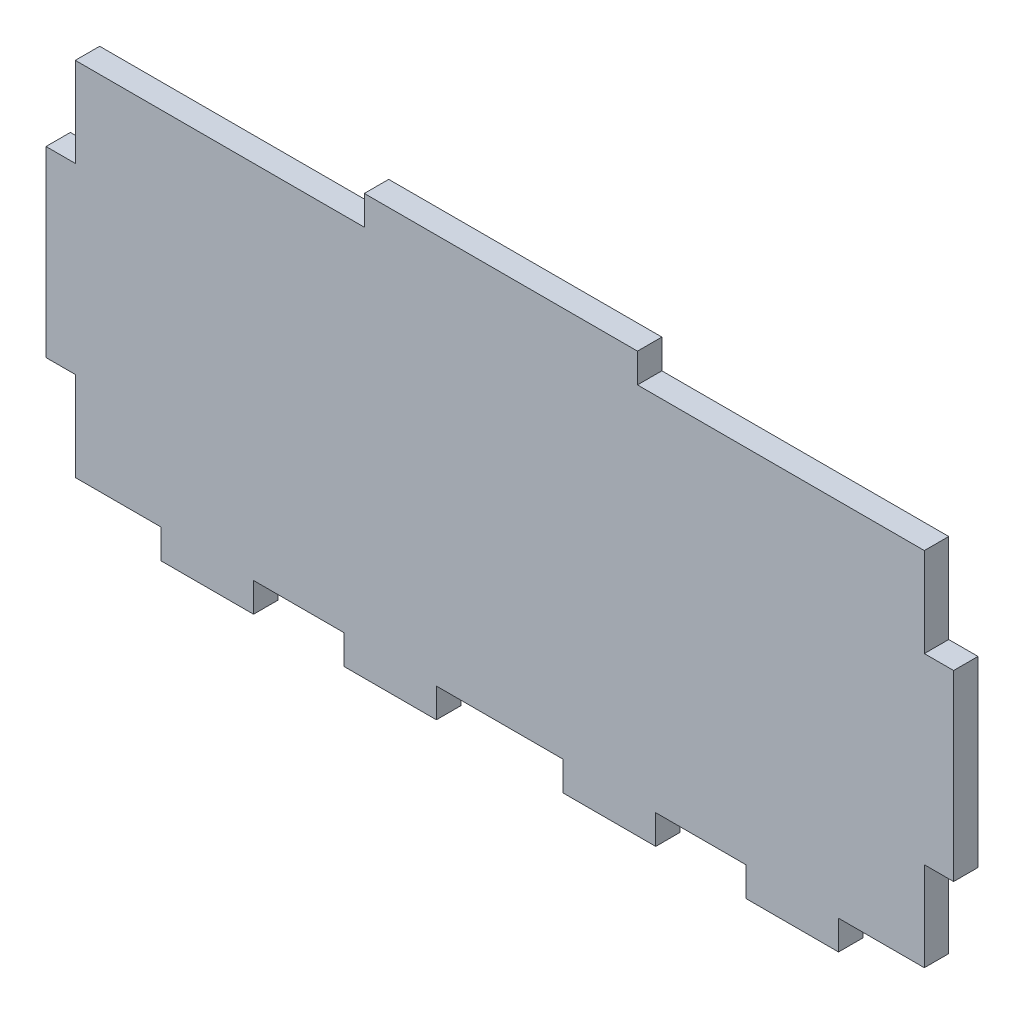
ISO-10303-21;
HEADER;
FILE_DESCRIPTION(('STEP AP214'),'2;1');
FILE_NAME('part.step','',(''),(''),'','','');
FILE_SCHEMA(('AUTOMOTIVE_DESIGN { 1 0 10303 214 1 1 1 1 }'));
ENDSEC;
DATA;
#1=APPLICATION_CONTEXT('core data for automotive mechanical design processes');
#2=APPLICATION_PROTOCOL_DEFINITION('international standard','automotive_design',2000,#1);
#3=PRODUCT_CONTEXT('',#1,'mechanical');
#4=PRODUCT('Part','Part','',(#3));
#5=PRODUCT_RELATED_PRODUCT_CATEGORY('part','',(#4));
#6=PRODUCT_DEFINITION_FORMATION('','',#4);
#7=PRODUCT_DEFINITION_CONTEXT('part definition',#1,'design');
#8=PRODUCT_DEFINITION('design','',#6,#7);
#9=PRODUCT_DEFINITION_SHAPE('','',#8);
#10=(LENGTH_UNIT() NAMED_UNIT(*) SI_UNIT(.MILLI.,.METRE.));
#11=(NAMED_UNIT(*) PLANE_ANGLE_UNIT() SI_UNIT($,.RADIAN.));
#12=(NAMED_UNIT(*) SI_UNIT($,.STERADIAN.) SOLID_ANGLE_UNIT());
#13=UNCERTAINTY_MEASURE_WITH_UNIT(LENGTH_MEASURE(1.E-05),#10,'distance_accuracy_value','');
#14=(GEOMETRIC_REPRESENTATION_CONTEXT(3) GLOBAL_UNCERTAINTY_ASSIGNED_CONTEXT((#13)) GLOBAL_UNIT_ASSIGNED_CONTEXT((#10,
#11,#12)) REPRESENTATION_CONTEXT('',''));
#15=CARTESIAN_POINT('',(0.,0.,0.));
#16=DIRECTION('',(0.,0.,1.));
#17=DIRECTION('',(1.,0.,0.));
#18=AXIS2_PLACEMENT_3D('',#15,#16,#17);
#19=CARTESIAN_POINT('',(-15.,20.,2.7));
#20=DIRECTION('',(0.,-1.,0.));
#21=DIRECTION('',(1.,0.,0.));
#22=AXIS2_PLACEMENT_3D('',#19,#20,#21);
#23=PLANE('',#22);
#24=DIRECTION('',(-1.,0.,0.));
#25=VECTOR('',#24,1.);
#26=CARTESIAN_POINT('',(-15.,20.,0.));
#27=LINE('',#26,#25);
#28=CARTESIAN_POINT('',(-15.,20.,0.));
#29=VERTEX_POINT('',#28);
#30=CARTESIAN_POINT('',(-47.,20.,0.));
#31=VERTEX_POINT('',#30);
#32=EDGE_CURVE('E281',#29,#31,#27,.T.);
#33=ORIENTED_EDGE('',*,*,#32,.T.);
#34=DIRECTION('',(0.,0.,-1.));
#35=VECTOR('',#34,1.);
#36=CARTESIAN_POINT('',(-47.,20.,2.7));
#37=LINE('',#36,#35);
#38=CARTESIAN_POINT('',(-47.,20.,2.7));
#39=VERTEX_POINT('',#38);
#40=EDGE_CURVE('E11',#39,#31,#37,.T.);
#41=ORIENTED_EDGE('',*,*,#40,.F.);
#42=DIRECTION('',(-1.,0.,0.));
#43=VECTOR('',#42,1.);
#44=CARTESIAN_POINT('',(-15.,20.,2.7));
#45=LINE('',#44,#43);
#46=CARTESIAN_POINT('',(-15.,20.,2.7));
#47=VERTEX_POINT('',#46);
#48=EDGE_CURVE('E343',#47,#39,#45,.T.);
#49=ORIENTED_EDGE('',*,*,#48,.F.);
#50=DIRECTION('',(0.,0.,-1.));
#51=VECTOR('',#50,1.);
#52=CARTESIAN_POINT('',(-15.,20.,2.7));
#53=LINE('',#52,#51);
#54=EDGE_CURVE('E277',#47,#29,#53,.T.);
#55=ORIENTED_EDGE('',*,*,#54,.T.);
#56=EDGE_LOOP('',(#33,#41,#49,#55));
#57=FACE_BOUND('',#56,.T.);
#58=ADVANCED_FACE('F41',(#57),#23,.F.);
#59=CARTESIAN_POINT('',(-47.,10.12,2.7));
#60=DIRECTION('',(1.,0.,0.));
#61=DIRECTION('',(0.,0.,-1.));
#62=AXIS2_PLACEMENT_3D('',#59,#60,#61);
#63=PLANE('',#62);
#64=DIRECTION('',(0.,-1.,0.));
#65=VECTOR('',#64,1.);
#66=CARTESIAN_POINT('',(-47.,10.12,0.));
#67=LINE('',#66,#65);
#68=CARTESIAN_POINT('',(-47.,10.12,0.));
#69=VERTEX_POINT('',#68);
#70=EDGE_CURVE('E284',#31,#69,#67,.T.);
#71=ORIENTED_EDGE('',*,*,#70,.T.);
#72=DIRECTION('',(0.,0.,-1.));
#73=VECTOR('',#72,1.);
#74=CARTESIAN_POINT('',(-47.,10.12,2.7));
#75=LINE('',#74,#73);
#76=CARTESIAN_POINT('',(-47.,10.12,2.7));
#77=VERTEX_POINT('',#76);
#78=EDGE_CURVE('E49',#77,#69,#75,.T.);
#79=ORIENTED_EDGE('',*,*,#78,.F.);
#80=DIRECTION('',(0.,-1.,0.));
#81=VECTOR('',#80,1.);
#82=CARTESIAN_POINT('',(-47.,10.12,2.7));
#83=LINE('',#82,#81);
#84=EDGE_CURVE('E172',#39,#77,#83,.T.);
#85=ORIENTED_EDGE('',*,*,#84,.F.);
#86=ORIENTED_EDGE('',*,*,#40,.T.);
#87=EDGE_LOOP('',(#71,#79,#85,#86));
#88=FACE_BOUND('',#87,.T.);
#89=ADVANCED_FACE('F521',(#88),#63,.F.);
#90=CARTESIAN_POINT('',(-47.,10.12,2.7));
#91=DIRECTION('',(0.,-1.,0.));
#92=DIRECTION('',(0.,0.,-1.));
#93=AXIS2_PLACEMENT_3D('',#90,#91,#92);
#94=PLANE('',#93);
#95=DIRECTION('',(-1.,0.,0.));
#96=VECTOR('',#95,1.);
#97=CARTESIAN_POINT('',(-47.,10.12,0.));
#98=LINE('',#97,#96);
#99=CARTESIAN_POINT('',(-50.24,10.12,0.));
#100=VERTEX_POINT('',#99);
#101=EDGE_CURVE('E286',#69,#100,#98,.T.);
#102=ORIENTED_EDGE('',*,*,#101,.T.);
#103=DIRECTION('',(0.,0.,-1.));
#104=VECTOR('',#103,1.);
#105=CARTESIAN_POINT('',(-50.24,10.12,2.7));
#106=LINE('',#105,#104);
#107=CARTESIAN_POINT('',(-50.24,10.12,2.7));
#108=VERTEX_POINT('',#107);
#109=EDGE_CURVE('E422',#108,#100,#106,.T.);
#110=ORIENTED_EDGE('',*,*,#109,.F.);
#111=DIRECTION('',(-1.,0.,0.));
#112=VECTOR('',#111,1.);
#113=CARTESIAN_POINT('',(-47.,10.12,2.7));
#114=LINE('',#113,#112);
#115=EDGE_CURVE('E430',#77,#108,#114,.T.);
#116=ORIENTED_EDGE('',*,*,#115,.F.);
#117=ORIENTED_EDGE('',*,*,#78,.T.);
#118=EDGE_LOOP('',(#102,#110,#116,#117));
#119=FACE_BOUND('',#118,.T.);
#120=ADVANCED_FACE('F428',(#119),#94,.F.);
#121=CARTESIAN_POINT('',(-50.24,10.12,2.7));
#122=DIRECTION('',(1.,0.,0.));
#123=DIRECTION('',(0.,0.,-1.));
#124=AXIS2_PLACEMENT_3D('',#121,#122,#123);
#125=PLANE('',#124);
#126=DIRECTION('',(0.,-1.,0.));
#127=VECTOR('',#126,1.);
#128=CARTESIAN_POINT('',(-50.24,10.12,0.));
#129=LINE('',#128,#127);
#130=CARTESIAN_POINT('',(-50.24,-10.12,0.));
#131=VERTEX_POINT('',#130);
#132=EDGE_CURVE('E288',#100,#131,#129,.T.);
#133=ORIENTED_EDGE('',*,*,#132,.T.);
#134=DIRECTION('',(0.,0.,-1.));
#135=VECTOR('',#134,1.);
#136=CARTESIAN_POINT('',(-50.24,-10.12,2.7));
#137=LINE('',#136,#135);
#138=CARTESIAN_POINT('',(-50.24,-10.12,2.7));
#139=VERTEX_POINT('',#138);
#140=EDGE_CURVE('E419',#139,#131,#137,.T.);
#141=ORIENTED_EDGE('',*,*,#140,.F.);
#142=DIRECTION('',(0.,-1.,0.));
#143=VECTOR('',#142,1.);
#144=CARTESIAN_POINT('',(-50.24,10.12,2.7));
#145=LINE('',#144,#143);
#146=EDGE_CURVE('E448',#108,#139,#145,.T.);
#147=ORIENTED_EDGE('',*,*,#146,.F.);
#148=ORIENTED_EDGE('',*,*,#109,.T.);
#149=EDGE_LOOP('',(#133,#141,#147,#148));
#150=FACE_BOUND('',#149,.T.);
#151=ADVANCED_FACE('F439',(#150),#125,.F.);
#152=CARTESIAN_POINT('',(-47.,-10.12,2.7));
#153=DIRECTION('',(0.,1.,0.));
#154=DIRECTION('',(0.,0.,1.));
#155=AXIS2_PLACEMENT_3D('',#152,#153,#154);
#156=PLANE('',#155);
#157=DIRECTION('',(1.,0.,0.));
#158=VECTOR('',#157,1.);
#159=CARTESIAN_POINT('',(-47.,-10.12,0.));
#160=LINE('',#159,#158);
#161=CARTESIAN_POINT('',(-47.,-10.12,0.));
#162=VERTEX_POINT('',#161);
#163=EDGE_CURVE('E290',#131,#162,#160,.T.);
#164=ORIENTED_EDGE('',*,*,#163,.T.);
#165=DIRECTION('',(0.,0.,-1.));
#166=VECTOR('',#165,1.);
#167=CARTESIAN_POINT('',(-47.,-10.12,2.7));
#168=LINE('',#167,#166);
#169=CARTESIAN_POINT('',(-47.,-10.12,2.7));
#170=VERTEX_POINT('',#169);
#171=EDGE_CURVE('E416',#170,#162,#168,.T.);
#172=ORIENTED_EDGE('',*,*,#171,.F.);
#173=DIRECTION('',(1.,0.,0.));
#174=VECTOR('',#173,1.);
#175=CARTESIAN_POINT('',(-47.,-10.12,2.7));
#176=LINE('',#175,#174);
#177=EDGE_CURVE('E445',#139,#170,#176,.T.);
#178=ORIENTED_EDGE('',*,*,#177,.F.);
#179=ORIENTED_EDGE('',*,*,#140,.T.);
#180=EDGE_LOOP('',(#164,#172,#178,#179));
#181=FACE_BOUND('',#180,.T.);
#182=ADVANCED_FACE('F443',(#181),#156,.F.);
#183=CARTESIAN_POINT('',(-47.,-20.,2.7));
#184=DIRECTION('',(1.,0.,0.));
#185=DIRECTION('',(0.,0.,-1.));
#186=AXIS2_PLACEMENT_3D('',#183,#184,#185);
#187=PLANE('',#186);
#188=DIRECTION('',(0.,-1.,0.));
#189=VECTOR('',#188,1.);
#190=CARTESIAN_POINT('',(-47.,-20.,0.));
#191=LINE('',#190,#189);
#192=CARTESIAN_POINT('',(-47.,-20.,0.));
#193=VERTEX_POINT('',#192);
#194=EDGE_CURVE('E292',#162,#193,#191,.T.);
#195=ORIENTED_EDGE('',*,*,#194,.T.);
#196=DIRECTION('',(0.,0.,-1.));
#197=VECTOR('',#196,1.);
#198=CARTESIAN_POINT('',(-47.,-20.,2.7));
#199=LINE('',#198,#197);
#200=CARTESIAN_POINT('',(-47.,-20.,2.7));
#201=VERTEX_POINT('',#200);
#202=EDGE_CURVE('E413',#201,#193,#199,.T.);
#203=ORIENTED_EDGE('',*,*,#202,.F.);
#204=DIRECTION('',(0.,-1.,0.));
#205=VECTOR('',#204,1.);
#206=CARTESIAN_POINT('',(-47.,-20.,2.7));
#207=LINE('',#206,#205);
#208=EDGE_CURVE('E447',#170,#201,#207,.T.);
#209=ORIENTED_EDGE('',*,*,#208,.F.);
#210=ORIENTED_EDGE('',*,*,#171,.T.);
#211=EDGE_LOOP('',(#195,#203,#209,#210));
#212=FACE_BOUND('',#211,.T.);
#213=ADVANCED_FACE('F534',(#212),#187,.F.);
#214=CARTESIAN_POINT('',(-37.5,-20.,2.7));
#215=DIRECTION('',(0.,1.,0.));
#216=DIRECTION('',(-1.,0.,0.));
#217=AXIS2_PLACEMENT_3D('',#214,#215,#216);
#218=PLANE('',#217);
#219=DIRECTION('',(1.,0.,0.));
#220=VECTOR('',#219,1.);
#221=CARTESIAN_POINT('',(-37.5,-20.,0.));
#222=LINE('',#221,#220);
#223=CARTESIAN_POINT('',(-37.5,-20.,0.));
#224=VERTEX_POINT('',#223);
#225=EDGE_CURVE('E294',#193,#224,#222,.T.);
#226=ORIENTED_EDGE('',*,*,#225,.T.);
#227=DIRECTION('',(0.,0.,-1.));
#228=VECTOR('',#227,1.);
#229=CARTESIAN_POINT('',(-37.5,-20.,2.7));
#230=LINE('',#229,#228);
#231=CARTESIAN_POINT('',(-37.5,-20.,2.7));
#232=VERTEX_POINT('',#231);
#233=EDGE_CURVE('E410',#232,#224,#230,.T.);
#234=ORIENTED_EDGE('',*,*,#233,.F.);
#235=DIRECTION('',(1.,0.,0.));
#236=VECTOR('',#235,1.);
#237=CARTESIAN_POINT('',(-37.5,-20.,2.7));
#238=LINE('',#237,#236);
#239=EDGE_CURVE('E450',#201,#232,#238,.T.);
#240=ORIENTED_EDGE('',*,*,#239,.F.);
#241=ORIENTED_EDGE('',*,*,#202,.T.);
#242=EDGE_LOOP('',(#226,#234,#240,#241));
#243=FACE_BOUND('',#242,.T.);
#244=ADVANCED_FACE('F537',(#243),#218,.F.);
#245=CARTESIAN_POINT('',(-37.5,-20.,2.7));
#246=DIRECTION('',(1.,0.,0.));
#247=DIRECTION('',(0.,0.,-1.));
#248=AXIS2_PLACEMENT_3D('',#245,#246,#247);
#249=PLANE('',#248);
#250=DIRECTION('',(0.,-1.,0.));
#251=VECTOR('',#250,1.);
#252=CARTESIAN_POINT('',(-37.5,-20.,0.));
#253=LINE('',#252,#251);
#254=CARTESIAN_POINT('',(-37.5,-23.24,0.));
#255=VERTEX_POINT('',#254);
#256=EDGE_CURVE('E296',#224,#255,#253,.T.);
#257=ORIENTED_EDGE('',*,*,#256,.T.);
#258=DIRECTION('',(0.,0.,-1.));
#259=VECTOR('',#258,1.);
#260=CARTESIAN_POINT('',(-37.5,-23.24,2.7));
#261=LINE('',#260,#259);
#262=CARTESIAN_POINT('',(-37.5,-23.24,2.7));
#263=VERTEX_POINT('',#262);
#264=EDGE_CURVE('E407',#263,#255,#261,.T.);
#265=ORIENTED_EDGE('',*,*,#264,.F.);
#266=DIRECTION('',(0.,-1.,0.));
#267=VECTOR('',#266,1.);
#268=CARTESIAN_POINT('',(-37.5,-20.,2.7));
#269=LINE('',#268,#267);
#270=EDGE_CURVE('E456',#232,#263,#269,.T.);
#271=ORIENTED_EDGE('',*,*,#270,.F.);
#272=ORIENTED_EDGE('',*,*,#233,.T.);
#273=EDGE_LOOP('',(#257,#265,#271,#272));
#274=FACE_BOUND('',#273,.T.);
#275=ADVANCED_FACE('F541',(#274),#249,.F.);
#276=CARTESIAN_POINT('',(-37.5,-23.24,2.7));
#277=DIRECTION('',(0.,1.,0.));
#278=DIRECTION('',(0.,0.,1.));
#279=AXIS2_PLACEMENT_3D('',#276,#277,#278);
#280=PLANE('',#279);
#281=DIRECTION('',(1.,0.,0.));
#282=VECTOR('',#281,1.);
#283=CARTESIAN_POINT('',(-37.5,-23.24,0.));
#284=LINE('',#283,#282);
#285=CARTESIAN_POINT('',(-27.26,-23.24,0.));
#286=VERTEX_POINT('',#285);
#287=EDGE_CURVE('E298',#255,#286,#284,.T.);
#288=ORIENTED_EDGE('',*,*,#287,.T.);
#289=DIRECTION('',(0.,0.,-1.));
#290=VECTOR('',#289,1.);
#291=CARTESIAN_POINT('',(-27.26,-23.24,2.7));
#292=LINE('',#291,#290);
#293=CARTESIAN_POINT('',(-27.26,-23.24,2.7));
#294=VERTEX_POINT('',#293);
#295=EDGE_CURVE('E404',#294,#286,#292,.T.);
#296=ORIENTED_EDGE('',*,*,#295,.F.);
#297=DIRECTION('',(1.,0.,0.));
#298=VECTOR('',#297,1.);
#299=CARTESIAN_POINT('',(-37.5,-23.24,2.7));
#300=LINE('',#299,#298);
#301=EDGE_CURVE('E458',#263,#294,#300,.T.);
#302=ORIENTED_EDGE('',*,*,#301,.F.);
#303=ORIENTED_EDGE('',*,*,#264,.T.);
#304=EDGE_LOOP('',(#288,#296,#302,#303));
#305=FACE_BOUND('',#304,.T.);
#306=ADVANCED_FACE('F545',(#305),#280,.F.);
#307=CARTESIAN_POINT('',(-27.26,-20.,2.7));
#308=DIRECTION('',(-1.,0.,0.));
#309=DIRECTION('',(0.,0.,1.));
#310=AXIS2_PLACEMENT_3D('',#307,#308,#309);
#311=PLANE('',#310);
#312=DIRECTION('',(0.,1.,0.));
#313=VECTOR('',#312,1.);
#314=CARTESIAN_POINT('',(-27.26,-20.,0.));
#315=LINE('',#314,#313);
#316=CARTESIAN_POINT('',(-27.26,-20.,0.));
#317=VERTEX_POINT('',#316);
#318=EDGE_CURVE('E300',#286,#317,#315,.T.);
#319=ORIENTED_EDGE('',*,*,#318,.T.);
#320=DIRECTION('',(0.,0.,-1.));
#321=VECTOR('',#320,1.);
#322=CARTESIAN_POINT('',(-27.26,-20.,2.7));
#323=LINE('',#322,#321);
#324=CARTESIAN_POINT('',(-27.26,-20.,2.7));
#325=VERTEX_POINT('',#324);
#326=EDGE_CURVE('E401',#325,#317,#323,.T.);
#327=ORIENTED_EDGE('',*,*,#326,.F.);
#328=DIRECTION('',(0.,1.,0.));
#329=VECTOR('',#328,1.);
#330=CARTESIAN_POINT('',(-27.26,-20.,2.7));
#331=LINE('',#330,#329);
#332=EDGE_CURVE('E460',#294,#325,#331,.T.);
#333=ORIENTED_EDGE('',*,*,#332,.F.);
#334=ORIENTED_EDGE('',*,*,#295,.T.);
#335=EDGE_LOOP('',(#319,#327,#333,#334));
#336=FACE_BOUND('',#335,.T.);
#337=ADVANCED_FACE('F549',(#336),#311,.F.);
#338=CARTESIAN_POINT('',(-17.26,-20.,2.7));
#339=DIRECTION('',(0.,1.,0.));
#340=DIRECTION('',(0.,0.,1.));
#341=AXIS2_PLACEMENT_3D('',#338,#339,#340);
#342=PLANE('',#341);
#343=DIRECTION('',(1.,0.,0.));
#344=VECTOR('',#343,1.);
#345=CARTESIAN_POINT('',(-17.26,-20.,0.));
#346=LINE('',#345,#344);
#347=CARTESIAN_POINT('',(-17.26,-20.,0.));
#348=VERTEX_POINT('',#347);
#349=EDGE_CURVE('E302',#317,#348,#346,.T.);
#350=ORIENTED_EDGE('',*,*,#349,.T.);
#351=DIRECTION('',(0.,0.,-1.));
#352=VECTOR('',#351,1.);
#353=CARTESIAN_POINT('',(-17.26,-20.,2.7));
#354=LINE('',#353,#352);
#355=CARTESIAN_POINT('',(-17.26,-20.,2.7));
#356=VERTEX_POINT('',#355);
#357=EDGE_CURVE('E398',#356,#348,#354,.T.);
#358=ORIENTED_EDGE('',*,*,#357,.F.);
#359=DIRECTION('',(1.,0.,0.));
#360=VECTOR('',#359,1.);
#361=CARTESIAN_POINT('',(-17.26,-20.,2.7));
#362=LINE('',#361,#360);
#363=EDGE_CURVE('E462',#325,#356,#362,.T.);
#364=ORIENTED_EDGE('',*,*,#363,.F.);
#365=ORIENTED_EDGE('',*,*,#326,.T.);
#366=EDGE_LOOP('',(#350,#358,#364,#365));
#367=FACE_BOUND('',#366,.T.);
#368=ADVANCED_FACE('F553',(#367),#342,.F.);
#369=CARTESIAN_POINT('',(-17.26,-20.,2.7));
#370=DIRECTION('',(1.,0.,0.));
#371=DIRECTION('',(0.,0.,-1.));
#372=AXIS2_PLACEMENT_3D('',#369,#370,#371);
#373=PLANE('',#372);
#374=DIRECTION('',(0.,-1.,0.));
#375=VECTOR('',#374,1.);
#376=CARTESIAN_POINT('',(-17.26,-20.,0.));
#377=LINE('',#376,#375);
#378=CARTESIAN_POINT('',(-17.26,-23.24,0.));
#379=VERTEX_POINT('',#378);
#380=EDGE_CURVE('E304',#348,#379,#377,.T.);
#381=ORIENTED_EDGE('',*,*,#380,.T.);
#382=DIRECTION('',(0.,0.,-1.));
#383=VECTOR('',#382,1.);
#384=CARTESIAN_POINT('',(-17.26,-23.24,2.7));
#385=LINE('',#384,#383);
#386=CARTESIAN_POINT('',(-17.26,-23.24,2.7));
#387=VERTEX_POINT('',#386);
#388=EDGE_CURVE('E395',#387,#379,#385,.T.);
#389=ORIENTED_EDGE('',*,*,#388,.F.);
#390=DIRECTION('',(0.,-1.,0.));
#391=VECTOR('',#390,1.);
#392=CARTESIAN_POINT('',(-17.26,-20.,2.7));
#393=LINE('',#392,#391);
#394=EDGE_CURVE('E464',#356,#387,#393,.T.);
#395=ORIENTED_EDGE('',*,*,#394,.F.);
#396=ORIENTED_EDGE('',*,*,#357,.T.);
#397=EDGE_LOOP('',(#381,#389,#395,#396));
#398=FACE_BOUND('',#397,.T.);
#399=ADVANCED_FACE('F557',(#398),#373,.F.);
#400=CARTESIAN_POINT('',(-17.26,-23.24,2.7));
#401=DIRECTION('',(0.,1.,0.));
#402=DIRECTION('',(0.,0.,1.));
#403=AXIS2_PLACEMENT_3D('',#400,#401,#402);
#404=PLANE('',#403);
#405=DIRECTION('',(1.,0.,0.));
#406=VECTOR('',#405,1.);
#407=CARTESIAN_POINT('',(-17.26,-23.24,0.));
#408=LINE('',#407,#406);
#409=CARTESIAN_POINT('',(-7.02,-23.24,0.));
#410=VERTEX_POINT('',#409);
#411=EDGE_CURVE('E306',#379,#410,#408,.T.);
#412=ORIENTED_EDGE('',*,*,#411,.T.);
#413=DIRECTION('',(0.,0.,-1.));
#414=VECTOR('',#413,1.);
#415=CARTESIAN_POINT('',(-7.02,-23.24,2.7));
#416=LINE('',#415,#414);
#417=CARTESIAN_POINT('',(-7.02,-23.24,2.7));
#418=VERTEX_POINT('',#417);
#419=EDGE_CURVE('E392',#418,#410,#416,.T.);
#420=ORIENTED_EDGE('',*,*,#419,.F.);
#421=DIRECTION('',(1.,0.,0.));
#422=VECTOR('',#421,1.);
#423=CARTESIAN_POINT('',(-17.26,-23.24,2.7));
#424=LINE('',#423,#422);
#425=EDGE_CURVE('E466',#387,#418,#424,.T.);
#426=ORIENTED_EDGE('',*,*,#425,.F.);
#427=ORIENTED_EDGE('',*,*,#388,.T.);
#428=EDGE_LOOP('',(#412,#420,#426,#427));
#429=FACE_BOUND('',#428,.T.);
#430=ADVANCED_FACE('F561',(#429),#404,.F.);
#431=CARTESIAN_POINT('',(-7.01999999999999,-20.,2.7));
#432=DIRECTION('',(-1.,0.,0.));
#433=DIRECTION('',(0.,-1.,0.));
#434=AXIS2_PLACEMENT_3D('',#431,#432,#433);
#435=PLANE('',#434);
#436=DIRECTION('',(0.,1.,0.));
#437=VECTOR('',#436,1.);
#438=CARTESIAN_POINT('',(-7.01999999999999,-20.,0.));
#439=LINE('',#438,#437);
#440=CARTESIAN_POINT('',(-7.01999999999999,-20.,0.));
#441=VERTEX_POINT('',#440);
#442=EDGE_CURVE('E308',#410,#441,#439,.T.);
#443=ORIENTED_EDGE('',*,*,#442,.T.);
#444=DIRECTION('',(0.,0.,-1.));
#445=VECTOR('',#444,1.);
#446=CARTESIAN_POINT('',(-7.01999999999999,-20.,2.7));
#447=LINE('',#446,#445);
#448=CARTESIAN_POINT('',(-7.01999999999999,-20.,2.7));
#449=VERTEX_POINT('',#448);
#450=EDGE_CURVE('E389',#449,#441,#447,.T.);
#451=ORIENTED_EDGE('',*,*,#450,.F.);
#452=DIRECTION('',(0.,1.,0.));
#453=VECTOR('',#452,1.);
#454=CARTESIAN_POINT('',(-7.01999999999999,-20.,2.7));
#455=LINE('',#454,#453);
#456=EDGE_CURVE('E468',#418,#449,#455,.T.);
#457=ORIENTED_EDGE('',*,*,#456,.F.);
#458=ORIENTED_EDGE('',*,*,#419,.T.);
#459=EDGE_LOOP('',(#443,#451,#457,#458));
#460=FACE_BOUND('',#459,.T.);
#461=ADVANCED_FACE('F565',(#460),#435,.F.);
#462=CARTESIAN_POINT('',(7.02,-20.,2.7));
#463=DIRECTION('',(0.,1.,0.));
#464=DIRECTION('',(0.,0.,1.));
#465=AXIS2_PLACEMENT_3D('',#462,#463,#464);
#466=PLANE('',#465);
#467=DIRECTION('',(1.,0.,0.));
#468=VECTOR('',#467,1.);
#469=CARTESIAN_POINT('',(7.02,-20.,0.));
#470=LINE('',#469,#468);
#471=CARTESIAN_POINT('',(7.02,-20.,0.));
#472=VERTEX_POINT('',#471);
#473=EDGE_CURVE('E310',#441,#472,#470,.T.);
#474=ORIENTED_EDGE('',*,*,#473,.T.);
#475=DIRECTION('',(0.,0.,-1.));
#476=VECTOR('',#475,1.);
#477=CARTESIAN_POINT('',(7.02,-20.,2.7));
#478=LINE('',#477,#476);
#479=CARTESIAN_POINT('',(7.02,-20.,2.7));
#480=VERTEX_POINT('',#479);
#481=EDGE_CURVE('E386',#480,#472,#478,.T.);
#482=ORIENTED_EDGE('',*,*,#481,.F.);
#483=DIRECTION('',(1.,0.,0.));
#484=VECTOR('',#483,1.);
#485=CARTESIAN_POINT('',(7.02,-20.,2.7));
#486=LINE('',#485,#484);
#487=EDGE_CURVE('E470',#449,#480,#486,.T.);
#488=ORIENTED_EDGE('',*,*,#487,.F.);
#489=ORIENTED_EDGE('',*,*,#450,.T.);
#490=EDGE_LOOP('',(#474,#482,#488,#489));
#491=FACE_BOUND('',#490,.T.);
#492=ADVANCED_FACE('F569',(#491),#466,.F.);
#493=CARTESIAN_POINT('',(7.02,-20.,2.7));
#494=DIRECTION('',(1.,0.,0.));
#495=DIRECTION('',(0.,1.,0.));
#496=AXIS2_PLACEMENT_3D('',#493,#494,#495);
#497=PLANE('',#496);
#498=DIRECTION('',(0.,-1.,0.));
#499=VECTOR('',#498,1.);
#500=CARTESIAN_POINT('',(7.02,-20.,0.));
#501=LINE('',#500,#499);
#502=CARTESIAN_POINT('',(7.02000000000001,-23.24,0.));
#503=VERTEX_POINT('',#502);
#504=EDGE_CURVE('E312',#472,#503,#501,.T.);
#505=ORIENTED_EDGE('',*,*,#504,.T.);
#506=DIRECTION('',(0.,0.,-1.));
#507=VECTOR('',#506,1.);
#508=CARTESIAN_POINT('',(7.02000000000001,-23.24,2.7));
#509=LINE('',#508,#507);
#510=CARTESIAN_POINT('',(7.02000000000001,-23.24,2.7));
#511=VERTEX_POINT('',#510);
#512=EDGE_CURVE('E383',#511,#503,#509,.T.);
#513=ORIENTED_EDGE('',*,*,#512,.F.);
#514=DIRECTION('',(0.,-1.,0.));
#515=VECTOR('',#514,1.);
#516=CARTESIAN_POINT('',(7.02,-20.,2.7));
#517=LINE('',#516,#515);
#518=EDGE_CURVE('E472',#480,#511,#517,.T.);
#519=ORIENTED_EDGE('',*,*,#518,.F.);
#520=ORIENTED_EDGE('',*,*,#481,.T.);
#521=EDGE_LOOP('',(#505,#513,#519,#520));
#522=FACE_BOUND('',#521,.T.);
#523=ADVANCED_FACE('F573',(#522),#497,.F.);
#524=CARTESIAN_POINT('',(17.26,-23.24,2.7));
#525=DIRECTION('',(0.,1.,0.));
#526=DIRECTION('',(-1.,0.,0.));
#527=AXIS2_PLACEMENT_3D('',#524,#525,#526);
#528=PLANE('',#527);
#529=DIRECTION('',(1.,0.,0.));
#530=VECTOR('',#529,1.);
#531=CARTESIAN_POINT('',(17.26,-23.24,0.));
#532=LINE('',#531,#530);
#533=CARTESIAN_POINT('',(17.26,-23.24,0.));
#534=VERTEX_POINT('',#533);
#535=EDGE_CURVE('E314',#503,#534,#532,.T.);
#536=ORIENTED_EDGE('',*,*,#535,.T.);
#537=DIRECTION('',(0.,0.,-1.));
#538=VECTOR('',#537,1.);
#539=CARTESIAN_POINT('',(17.26,-23.24,2.7));
#540=LINE('',#539,#538);
#541=CARTESIAN_POINT('',(17.26,-23.24,2.7));
#542=VERTEX_POINT('',#541);
#543=EDGE_CURVE('E380',#542,#534,#540,.T.);
#544=ORIENTED_EDGE('',*,*,#543,.F.);
#545=DIRECTION('',(1.,0.,0.));
#546=VECTOR('',#545,1.);
#547=CARTESIAN_POINT('',(17.26,-23.24,2.7));
#548=LINE('',#547,#546);
#549=EDGE_CURVE('E474',#511,#542,#548,.T.);
#550=ORIENTED_EDGE('',*,*,#549,.F.);
#551=ORIENTED_EDGE('',*,*,#512,.T.);
#552=EDGE_LOOP('',(#536,#544,#550,#551));
#553=FACE_BOUND('',#552,.T.);
#554=ADVANCED_FACE('F577',(#553),#528,.F.);
#555=CARTESIAN_POINT('',(17.26,-20.,2.7));
#556=DIRECTION('',(-1.,0.,0.));
#557=DIRECTION('',(0.,0.,1.));
#558=AXIS2_PLACEMENT_3D('',#555,#556,#557);
#559=PLANE('',#558);
#560=DIRECTION('',(0.,1.,0.));
#561=VECTOR('',#560,1.);
#562=CARTESIAN_POINT('',(17.26,-20.,0.));
#563=LINE('',#562,#561);
#564=CARTESIAN_POINT('',(17.26,-20.,0.));
#565=VERTEX_POINT('',#564);
#566=EDGE_CURVE('E316',#534,#565,#563,.T.);
#567=ORIENTED_EDGE('',*,*,#566,.T.);
#568=DIRECTION('',(0.,0.,-1.));
#569=VECTOR('',#568,1.);
#570=CARTESIAN_POINT('',(17.26,-20.,2.7));
#571=LINE('',#570,#569);
#572=CARTESIAN_POINT('',(17.26,-20.,2.7));
#573=VERTEX_POINT('',#572);
#574=EDGE_CURVE('E377',#573,#565,#571,.T.);
#575=ORIENTED_EDGE('',*,*,#574,.F.);
#576=DIRECTION('',(0.,1.,0.));
#577=VECTOR('',#576,1.);
#578=CARTESIAN_POINT('',(17.26,-20.,2.7));
#579=LINE('',#578,#577);
#580=EDGE_CURVE('E476',#542,#573,#579,.T.);
#581=ORIENTED_EDGE('',*,*,#580,.F.);
#582=ORIENTED_EDGE('',*,*,#543,.T.);
#583=EDGE_LOOP('',(#567,#575,#581,#582));
#584=FACE_BOUND('',#583,.T.);
#585=ADVANCED_FACE('F581',(#584),#559,.F.);
#586=CARTESIAN_POINT('',(27.26,-20.,2.7));
#587=DIRECTION('',(0.,1.,0.));
#588=DIRECTION('',(-1.,0.,0.));
#589=AXIS2_PLACEMENT_3D('',#586,#587,#588);
#590=PLANE('',#589);
#591=DIRECTION('',(1.,0.,0.));
#592=VECTOR('',#591,1.);
#593=CARTESIAN_POINT('',(27.26,-20.,0.));
#594=LINE('',#593,#592);
#595=CARTESIAN_POINT('',(27.26,-20.,0.));
#596=VERTEX_POINT('',#595);
#597=EDGE_CURVE('E318',#565,#596,#594,.T.);
#598=ORIENTED_EDGE('',*,*,#597,.T.);
#599=DIRECTION('',(0.,0.,-1.));
#600=VECTOR('',#599,1.);
#601=CARTESIAN_POINT('',(27.26,-20.,2.7));
#602=LINE('',#601,#600);
#603=CARTESIAN_POINT('',(27.26,-20.,2.7));
#604=VERTEX_POINT('',#603);
#605=EDGE_CURVE('E374',#604,#596,#602,.T.);
#606=ORIENTED_EDGE('',*,*,#605,.F.);
#607=DIRECTION('',(1.,0.,0.));
#608=VECTOR('',#607,1.);
#609=CARTESIAN_POINT('',(27.26,-20.,2.7));
#610=LINE('',#609,#608);
#611=EDGE_CURVE('E478',#573,#604,#610,.T.);
#612=ORIENTED_EDGE('',*,*,#611,.F.);
#613=ORIENTED_EDGE('',*,*,#574,.T.);
#614=EDGE_LOOP('',(#598,#606,#612,#613));
#615=FACE_BOUND('',#614,.T.);
#616=ADVANCED_FACE('F585',(#615),#590,.F.);
#617=CARTESIAN_POINT('',(27.26,-20.,2.7));
#618=DIRECTION('',(1.,0.,0.));
#619=DIRECTION('',(0.,0.,-1.));
#620=AXIS2_PLACEMENT_3D('',#617,#618,#619);
#621=PLANE('',#620);
#622=DIRECTION('',(0.,-1.,0.));
#623=VECTOR('',#622,1.);
#624=CARTESIAN_POINT('',(27.26,-20.,0.));
#625=LINE('',#624,#623);
#626=CARTESIAN_POINT('',(27.26,-23.24,0.));
#627=VERTEX_POINT('',#626);
#628=EDGE_CURVE('E320',#596,#627,#625,.T.);
#629=ORIENTED_EDGE('',*,*,#628,.T.);
#630=DIRECTION('',(0.,0.,-1.));
#631=VECTOR('',#630,1.);
#632=CARTESIAN_POINT('',(27.26,-23.24,2.7));
#633=LINE('',#632,#631);
#634=CARTESIAN_POINT('',(27.26,-23.24,2.7));
#635=VERTEX_POINT('',#634);
#636=EDGE_CURVE('E371',#635,#627,#633,.T.);
#637=ORIENTED_EDGE('',*,*,#636,.F.);
#638=DIRECTION('',(0.,-1.,0.));
#639=VECTOR('',#638,1.);
#640=CARTESIAN_POINT('',(27.26,-20.,2.7));
#641=LINE('',#640,#639);
#642=EDGE_CURVE('E480',#604,#635,#641,.T.);
#643=ORIENTED_EDGE('',*,*,#642,.F.);
#644=ORIENTED_EDGE('',*,*,#605,.T.);
#645=EDGE_LOOP('',(#629,#637,#643,#644));
#646=FACE_BOUND('',#645,.T.);
#647=ADVANCED_FACE('F589',(#646),#621,.F.);
#648=CARTESIAN_POINT('',(37.5,-23.24,2.7));
#649=DIRECTION('',(0.,1.,0.));
#650=DIRECTION('',(-1.,0.,0.));
#651=AXIS2_PLACEMENT_3D('',#648,#649,#650);
#652=PLANE('',#651);
#653=DIRECTION('',(1.,0.,0.));
#654=VECTOR('',#653,1.);
#655=CARTESIAN_POINT('',(37.5,-23.24,0.));
#656=LINE('',#655,#654);
#657=CARTESIAN_POINT('',(37.5,-23.24,0.));
#658=VERTEX_POINT('',#657);
#659=EDGE_CURVE('E322',#627,#658,#656,.T.);
#660=ORIENTED_EDGE('',*,*,#659,.T.);
#661=DIRECTION('',(0.,0.,-1.));
#662=VECTOR('',#661,1.);
#663=CARTESIAN_POINT('',(37.5,-23.24,2.7));
#664=LINE('',#663,#662);
#665=CARTESIAN_POINT('',(37.5,-23.24,2.7));
#666=VERTEX_POINT('',#665);
#667=EDGE_CURVE('E368',#666,#658,#664,.T.);
#668=ORIENTED_EDGE('',*,*,#667,.F.);
#669=DIRECTION('',(1.,0.,0.));
#670=VECTOR('',#669,1.);
#671=CARTESIAN_POINT('',(37.5,-23.24,2.7));
#672=LINE('',#671,#670);
#673=EDGE_CURVE('E482',#635,#666,#672,.T.);
#674=ORIENTED_EDGE('',*,*,#673,.F.);
#675=ORIENTED_EDGE('',*,*,#636,.T.);
#676=EDGE_LOOP('',(#660,#668,#674,#675));
#677=FACE_BOUND('',#676,.T.);
#678=ADVANCED_FACE('F593',(#677),#652,.F.);
#679=CARTESIAN_POINT('',(37.5,-20.,2.7));
#680=DIRECTION('',(-1.,0.,0.));
#681=DIRECTION('',(0.,0.,1.));
#682=AXIS2_PLACEMENT_3D('',#679,#680,#681);
#683=PLANE('',#682);
#684=DIRECTION('',(0.,1.,0.));
#685=VECTOR('',#684,1.);
#686=CARTESIAN_POINT('',(37.5,-20.,0.));
#687=LINE('',#686,#685);
#688=CARTESIAN_POINT('',(37.5,-20.,0.));
#689=VERTEX_POINT('',#688);
#690=EDGE_CURVE('E324',#658,#689,#687,.T.);
#691=ORIENTED_EDGE('',*,*,#690,.T.);
#692=DIRECTION('',(0.,0.,-1.));
#693=VECTOR('',#692,1.);
#694=CARTESIAN_POINT('',(37.5,-20.,2.7));
#695=LINE('',#694,#693);
#696=CARTESIAN_POINT('',(37.5,-20.,2.7));
#697=VERTEX_POINT('',#696);
#698=EDGE_CURVE('E365',#697,#689,#695,.T.);
#699=ORIENTED_EDGE('',*,*,#698,.F.);
#700=DIRECTION('',(0.,1.,0.));
#701=VECTOR('',#700,1.);
#702=CARTESIAN_POINT('',(37.5,-20.,2.7));
#703=LINE('',#702,#701);
#704=EDGE_CURVE('E484',#666,#697,#703,.T.);
#705=ORIENTED_EDGE('',*,*,#704,.F.);
#706=ORIENTED_EDGE('',*,*,#667,.T.);
#707=EDGE_LOOP('',(#691,#699,#705,#706));
#708=FACE_BOUND('',#707,.T.);
#709=ADVANCED_FACE('F597',(#708),#683,.F.);
#710=CARTESIAN_POINT('',(47.,-20.,2.7));
#711=DIRECTION('',(0.,1.,0.));
#712=DIRECTION('',(-1.,0.,0.));
#713=AXIS2_PLACEMENT_3D('',#710,#711,#712);
#714=PLANE('',#713);
#715=DIRECTION('',(1.,0.,0.));
#716=VECTOR('',#715,1.);
#717=CARTESIAN_POINT('',(47.,-20.,0.));
#718=LINE('',#717,#716);
#719=CARTESIAN_POINT('',(47.,-20.,0.));
#720=VERTEX_POINT('',#719);
#721=EDGE_CURVE('E326',#689,#720,#718,.T.);
#722=ORIENTED_EDGE('',*,*,#721,.T.);
#723=DIRECTION('',(0.,0.,-1.));
#724=VECTOR('',#723,1.);
#725=CARTESIAN_POINT('',(47.,-20.,2.7));
#726=LINE('',#725,#724);
#727=CARTESIAN_POINT('',(47.,-20.,2.7));
#728=VERTEX_POINT('',#727);
#729=EDGE_CURVE('E362',#728,#720,#726,.T.);
#730=ORIENTED_EDGE('',*,*,#729,.F.);
#731=DIRECTION('',(1.,0.,0.));
#732=VECTOR('',#731,1.);
#733=CARTESIAN_POINT('',(47.,-20.,2.7));
#734=LINE('',#733,#732);
#735=EDGE_CURVE('E486',#697,#728,#734,.T.);
#736=ORIENTED_EDGE('',*,*,#735,.F.);
#737=ORIENTED_EDGE('',*,*,#698,.T.);
#738=EDGE_LOOP('',(#722,#730,#736,#737));
#739=FACE_BOUND('',#738,.T.);
#740=ADVANCED_FACE('F601',(#739),#714,.F.);
#741=CARTESIAN_POINT('',(47.,-20.,2.7));
#742=DIRECTION('',(-1.,0.,0.));
#743=DIRECTION('',(0.,0.,1.));
#744=AXIS2_PLACEMENT_3D('',#741,#742,#743);
#745=PLANE('',#744);
#746=DIRECTION('',(0.,1.,0.));
#747=VECTOR('',#746,1.);
#748=CARTESIAN_POINT('',(47.,-20.,0.));
#749=LINE('',#748,#747);
#750=CARTESIAN_POINT('',(47.,-10.12,0.));
#751=VERTEX_POINT('',#750);
#752=EDGE_CURVE('E328',#720,#751,#749,.T.);
#753=ORIENTED_EDGE('',*,*,#752,.T.);
#754=DIRECTION('',(0.,0.,-1.));
#755=VECTOR('',#754,1.);
#756=CARTESIAN_POINT('',(47.,-10.12,2.7));
#757=LINE('',#756,#755);
#758=CARTESIAN_POINT('',(47.,-10.12,2.7));
#759=VERTEX_POINT('',#758);
#760=EDGE_CURVE('E359',#759,#751,#757,.T.);
#761=ORIENTED_EDGE('',*,*,#760,.F.);
#762=DIRECTION('',(0.,1.,0.));
#763=VECTOR('',#762,1.);
#764=CARTESIAN_POINT('',(47.,-20.,2.7));
#765=LINE('',#764,#763);
#766=EDGE_CURVE('E488',#728,#759,#765,.T.);
#767=ORIENTED_EDGE('',*,*,#766,.F.);
#768=ORIENTED_EDGE('',*,*,#729,.T.);
#769=EDGE_LOOP('',(#753,#761,#767,#768));
#770=FACE_BOUND('',#769,.T.);
#771=ADVANCED_FACE('F605',(#770),#745,.F.);
#772=CARTESIAN_POINT('',(47.,-10.12,2.7));
#773=DIRECTION('',(0.,1.,0.));
#774=DIRECTION('',(0.,0.,1.));
#775=AXIS2_PLACEMENT_3D('',#772,#773,#774);
#776=PLANE('',#775);
#777=DIRECTION('',(1.,0.,0.));
#778=VECTOR('',#777,1.);
#779=CARTESIAN_POINT('',(47.,-10.12,0.));
#780=LINE('',#779,#778);
#781=CARTESIAN_POINT('',(50.24,-10.12,0.));
#782=VERTEX_POINT('',#781);
#783=EDGE_CURVE('E330',#751,#782,#780,.T.);
#784=ORIENTED_EDGE('',*,*,#783,.T.);
#785=DIRECTION('',(0.,0.,-1.));
#786=VECTOR('',#785,1.);
#787=CARTESIAN_POINT('',(50.24,-10.12,2.7));
#788=LINE('',#787,#786);
#789=CARTESIAN_POINT('',(50.24,-10.12,2.7));
#790=VERTEX_POINT('',#789);
#791=EDGE_CURVE('E356',#790,#782,#788,.T.);
#792=ORIENTED_EDGE('',*,*,#791,.F.);
#793=DIRECTION('',(1.,0.,0.));
#794=VECTOR('',#793,1.);
#795=CARTESIAN_POINT('',(47.,-10.12,2.7));
#796=LINE('',#795,#794);
#797=EDGE_CURVE('E490',#759,#790,#796,.T.);
#798=ORIENTED_EDGE('',*,*,#797,.F.);
#799=ORIENTED_EDGE('',*,*,#760,.T.);
#800=EDGE_LOOP('',(#784,#792,#798,#799));
#801=FACE_BOUND('',#800,.T.);
#802=ADVANCED_FACE('F609',(#801),#776,.F.);
#803=CARTESIAN_POINT('',(50.24,10.12,2.7));
#804=DIRECTION('',(-1.,0.,0.));
#805=DIRECTION('',(0.,-1.,0.));
#806=AXIS2_PLACEMENT_3D('',#803,#804,#805);
#807=PLANE('',#806);
#808=DIRECTION('',(0.,1.,0.));
#809=VECTOR('',#808,1.);
#810=CARTESIAN_POINT('',(50.24,10.12,0.));
#811=LINE('',#810,#809);
#812=CARTESIAN_POINT('',(50.24,10.12,0.));
#813=VERTEX_POINT('',#812);
#814=EDGE_CURVE('E332',#782,#813,#811,.T.);
#815=ORIENTED_EDGE('',*,*,#814,.T.);
#816=DIRECTION('',(0.,0.,-1.));
#817=VECTOR('',#816,1.);
#818=CARTESIAN_POINT('',(50.24,10.12,2.7));
#819=LINE('',#818,#817);
#820=CARTESIAN_POINT('',(50.24,10.12,2.7));
#821=VERTEX_POINT('',#820);
#822=EDGE_CURVE('E353',#821,#813,#819,.T.);
#823=ORIENTED_EDGE('',*,*,#822,.F.);
#824=DIRECTION('',(0.,1.,0.));
#825=VECTOR('',#824,1.);
#826=CARTESIAN_POINT('',(50.24,10.12,2.7));
#827=LINE('',#826,#825);
#828=EDGE_CURVE('E492',#790,#821,#827,.T.);
#829=ORIENTED_EDGE('',*,*,#828,.F.);
#830=ORIENTED_EDGE('',*,*,#791,.T.);
#831=EDGE_LOOP('',(#815,#823,#829,#830));
#832=FACE_BOUND('',#831,.T.);
#833=ADVANCED_FACE('F613',(#832),#807,.F.);
#834=CARTESIAN_POINT('',(47.,10.12,2.7));
#835=DIRECTION('',(0.,-1.,0.));
#836=DIRECTION('',(0.,0.,-1.));
#837=AXIS2_PLACEMENT_3D('',#834,#835,#836);
#838=PLANE('',#837);
#839=DIRECTION('',(-1.,0.,0.));
#840=VECTOR('',#839,1.);
#841=CARTESIAN_POINT('',(47.,10.12,0.));
#842=LINE('',#841,#840);
#843=CARTESIAN_POINT('',(47.,10.12,0.));
#844=VERTEX_POINT('',#843);
#845=EDGE_CURVE('E334',#813,#844,#842,.T.);
#846=ORIENTED_EDGE('',*,*,#845,.T.);
#847=DIRECTION('',(0.,0.,-1.));
#848=VECTOR('',#847,1.);
#849=CARTESIAN_POINT('',(47.,10.12,2.7));
#850=LINE('',#849,#848);
#851=CARTESIAN_POINT('',(47.,10.12,2.7));
#852=VERTEX_POINT('',#851);
#853=EDGE_CURVE('E350',#852,#844,#850,.T.);
#854=ORIENTED_EDGE('',*,*,#853,.F.);
#855=DIRECTION('',(-1.,0.,0.));
#856=VECTOR('',#855,1.);
#857=CARTESIAN_POINT('',(47.,10.12,2.7));
#858=LINE('',#857,#856);
#859=EDGE_CURVE('E494',#821,#852,#858,.T.);
#860=ORIENTED_EDGE('',*,*,#859,.F.);
#861=ORIENTED_EDGE('',*,*,#822,.T.);
#862=EDGE_LOOP('',(#846,#854,#860,#861));
#863=FACE_BOUND('',#862,.T.);
#864=ADVANCED_FACE('F617',(#863),#838,.F.);
#865=CARTESIAN_POINT('',(47.,10.12,2.7));
#866=DIRECTION('',(-1.,0.,0.));
#867=DIRECTION('',(0.,0.,1.));
#868=AXIS2_PLACEMENT_3D('',#865,#866,#867);
#869=PLANE('',#868);
#870=DIRECTION('',(0.,1.,0.));
#871=VECTOR('',#870,1.);
#872=CARTESIAN_POINT('',(47.,10.12,0.));
#873=LINE('',#872,#871);
#874=CARTESIAN_POINT('',(47.,20.,0.));
#875=VERTEX_POINT('',#874);
#876=EDGE_CURVE('E336',#844,#875,#873,.T.);
#877=ORIENTED_EDGE('',*,*,#876,.T.);
#878=DIRECTION('',(0.,0.,-1.));
#879=VECTOR('',#878,1.);
#880=CARTESIAN_POINT('',(47.,20.,2.7));
#881=LINE('',#880,#879);
#882=CARTESIAN_POINT('',(47.,20.,2.7));
#883=VERTEX_POINT('',#882);
#884=EDGE_CURVE('E347',#883,#875,#881,.T.);
#885=ORIENTED_EDGE('',*,*,#884,.F.);
#886=DIRECTION('',(0.,1.,0.));
#887=VECTOR('',#886,1.);
#888=CARTESIAN_POINT('',(47.,10.12,2.7));
#889=LINE('',#888,#887);
#890=EDGE_CURVE('E496',#852,#883,#889,.T.);
#891=ORIENTED_EDGE('',*,*,#890,.F.);
#892=ORIENTED_EDGE('',*,*,#853,.T.);
#893=EDGE_LOOP('',(#877,#885,#891,#892));
#894=FACE_BOUND('',#893,.T.);
#895=ADVANCED_FACE('F502',(#894),#869,.F.);
#896=CARTESIAN_POINT('',(47.,20.,2.7));
#897=DIRECTION('',(0.,-1.,0.));
#898=DIRECTION('',(1.,0.,0.));
#899=AXIS2_PLACEMENT_3D('',#896,#897,#898);
#900=PLANE('',#899);
#901=DIRECTION('',(-1.,0.,0.));
#902=VECTOR('',#901,1.);
#903=CARTESIAN_POINT('',(47.,20.,0.));
#904=LINE('',#903,#902);
#905=CARTESIAN_POINT('',(15.24,20.,0.));
#906=VERTEX_POINT('',#905);
#907=EDGE_CURVE('E338',#875,#906,#904,.T.);
#908=ORIENTED_EDGE('',*,*,#907,.T.);
#909=DIRECTION('',(0.,0.,-1.));
#910=VECTOR('',#909,1.);
#911=CARTESIAN_POINT('',(15.24,20.,2.7));
#912=LINE('',#911,#910);
#913=CARTESIAN_POINT('',(15.24,20.,2.7));
#914=VERTEX_POINT('',#913);
#915=EDGE_CURVE('E272',#914,#906,#912,.T.);
#916=ORIENTED_EDGE('',*,*,#915,.F.);
#917=DIRECTION('',(-1.,0.,0.));
#918=VECTOR('',#917,1.);
#919=CARTESIAN_POINT('',(47.,20.,2.7));
#920=LINE('',#919,#918);
#921=EDGE_CURVE('E263',#883,#914,#920,.T.);
#922=ORIENTED_EDGE('',*,*,#921,.F.);
#923=ORIENTED_EDGE('',*,*,#884,.T.);
#924=EDGE_LOOP('',(#908,#916,#922,#923));
#925=FACE_BOUND('',#924,.T.);
#926=ADVANCED_FACE('F506',(#925),#900,.F.);
#927=CARTESIAN_POINT('',(15.24,20.,2.7));
#928=DIRECTION('',(-1.,0.,0.));
#929=DIRECTION('',(0.,0.,1.));
#930=AXIS2_PLACEMENT_3D('',#927,#928,#929);
#931=PLANE('',#930);
#932=DIRECTION('',(0.,1.,0.));
#933=VECTOR('',#932,1.);
#934=CARTESIAN_POINT('',(15.24,20.,0.));
#935=LINE('',#934,#933);
#936=CARTESIAN_POINT('',(15.24,23.24,0.));
#937=VERTEX_POINT('',#936);
#938=EDGE_CURVE('E271',#906,#937,#935,.T.);
#939=ORIENTED_EDGE('',*,*,#938,.T.);
#940=DIRECTION('',(0.,0.,-1.));
#941=VECTOR('',#940,1.);
#942=CARTESIAN_POINT('',(15.24,23.24,2.7));
#943=LINE('',#942,#941);
#944=CARTESIAN_POINT('',(15.24,23.24,2.7));
#945=VERTEX_POINT('',#944);
#946=EDGE_CURVE('E268',#945,#937,#943,.T.);
#947=ORIENTED_EDGE('',*,*,#946,.F.);
#948=DIRECTION('',(0.,1.,0.));
#949=VECTOR('',#948,1.);
#950=CARTESIAN_POINT('',(15.24,20.,2.7));
#951=LINE('',#950,#949);
#952=EDGE_CURVE('E257',#914,#945,#951,.T.);
#953=ORIENTED_EDGE('',*,*,#952,.F.);
#954=ORIENTED_EDGE('',*,*,#915,.T.);
#955=EDGE_LOOP('',(#939,#947,#953,#954));
#956=FACE_BOUND('',#955,.T.);
#957=ADVANCED_FACE('F269',(#956),#931,.F.);
#958=CARTESIAN_POINT('',(-15.,23.24,2.7));
#959=DIRECTION('',(0.,-1.,0.));
#960=DIRECTION('',(0.,0.,-1.));
#961=AXIS2_PLACEMENT_3D('',#958,#959,#960);
#962=PLANE('',#961);
#963=DIRECTION('',(-1.,0.,0.));
#964=VECTOR('',#963,1.);
#965=CARTESIAN_POINT('',(-15.,23.24,0.));
#966=LINE('',#965,#964);
#967=CARTESIAN_POINT('',(-15.,23.24,0.));
#968=VERTEX_POINT('',#967);
#969=EDGE_CURVE('E158',#937,#968,#966,.T.);
#970=ORIENTED_EDGE('',*,*,#969,.T.);
#971=DIRECTION('',(0.,0.,-1.));
#972=VECTOR('',#971,1.);
#973=CARTESIAN_POINT('',(-15.,23.24,2.7));
#974=LINE('',#973,#972);
#975=CARTESIAN_POINT('',(-15.,23.24,2.7));
#976=VERTEX_POINT('',#975);
#977=EDGE_CURVE('E273',#976,#968,#974,.T.);
#978=ORIENTED_EDGE('',*,*,#977,.F.);
#979=DIRECTION('',(-1.,0.,0.));
#980=VECTOR('',#979,1.);
#981=CARTESIAN_POINT('',(-15.,23.24,2.7));
#982=LINE('',#981,#980);
#983=EDGE_CURVE('E261',#945,#976,#982,.T.);
#984=ORIENTED_EDGE('',*,*,#983,.F.);
#985=ORIENTED_EDGE('',*,*,#946,.T.);
#986=EDGE_LOOP('',(#970,#978,#984,#985));
#987=FACE_BOUND('',#986,.T.);
#988=ADVANCED_FACE('F275',(#987),#962,.F.);
#989=CARTESIAN_POINT('',(-15.,20.,2.7));
#990=DIRECTION('',(1.,0.,0.));
#991=DIRECTION('',(0.,0.,-1.));
#992=AXIS2_PLACEMENT_3D('',#989,#990,#991);
#993=PLANE('',#992);
#994=DIRECTION('',(0.,-1.,0.));
#995=VECTOR('',#994,1.);
#996=CARTESIAN_POINT('',(-15.,20.,0.));
#997=LINE('',#996,#995);
#998=EDGE_CURVE('E164',#968,#29,#997,.T.);
#999=ORIENTED_EDGE('',*,*,#998,.T.);
#1000=ORIENTED_EDGE('',*,*,#54,.F.);
#1001=DIRECTION('',(0.,-1.,0.));
#1002=VECTOR('',#1001,1.);
#1003=CARTESIAN_POINT('',(-15.,20.,2.7));
#1004=LINE('',#1003,#1002);
#1005=EDGE_CURVE('E57',#976,#47,#1004,.T.);
#1006=ORIENTED_EDGE('',*,*,#1005,.F.);
#1007=ORIENTED_EDGE('',*,*,#977,.T.);
#1008=EDGE_LOOP('',(#999,#1000,#1006,#1007));
#1009=FACE_BOUND('',#1008,.T.);
#1010=ADVANCED_FACE('F510',(#1009),#993,.F.);
#1011=CARTESIAN_POINT('',(0.,0.,2.7));
#1012=DIRECTION('',(0.,0.,-1.));
#1013=DIRECTION('',(-1.,0.,0.));
#1014=AXIS2_PLACEMENT_3D('',#1011,#1012,#1013);
#1015=PLANE('',#1014);
#1016=ORIENTED_EDGE('',*,*,#48,.T.);
#1017=ORIENTED_EDGE('',*,*,#84,.T.);
#1018=ORIENTED_EDGE('',*,*,#115,.T.);
#1019=ORIENTED_EDGE('',*,*,#146,.T.);
#1020=ORIENTED_EDGE('',*,*,#177,.T.);
#1021=ORIENTED_EDGE('',*,*,#208,.T.);
#1022=ORIENTED_EDGE('',*,*,#239,.T.);
#1023=ORIENTED_EDGE('',*,*,#270,.T.);
#1024=ORIENTED_EDGE('',*,*,#301,.T.);
#1025=ORIENTED_EDGE('',*,*,#332,.T.);
#1026=ORIENTED_EDGE('',*,*,#363,.T.);
#1027=ORIENTED_EDGE('',*,*,#394,.T.);
#1028=ORIENTED_EDGE('',*,*,#425,.T.);
#1029=ORIENTED_EDGE('',*,*,#456,.T.);
#1030=ORIENTED_EDGE('',*,*,#487,.T.);
#1031=ORIENTED_EDGE('',*,*,#518,.T.);
#1032=ORIENTED_EDGE('',*,*,#549,.T.);
#1033=ORIENTED_EDGE('',*,*,#580,.T.);
#1034=ORIENTED_EDGE('',*,*,#611,.T.);
#1035=ORIENTED_EDGE('',*,*,#642,.T.);
#1036=ORIENTED_EDGE('',*,*,#673,.T.);
#1037=ORIENTED_EDGE('',*,*,#704,.T.);
#1038=ORIENTED_EDGE('',*,*,#735,.T.);
#1039=ORIENTED_EDGE('',*,*,#766,.T.);
#1040=ORIENTED_EDGE('',*,*,#797,.T.);
#1041=ORIENTED_EDGE('',*,*,#828,.T.);
#1042=ORIENTED_EDGE('',*,*,#859,.T.);
#1043=ORIENTED_EDGE('',*,*,#890,.T.);
#1044=ORIENTED_EDGE('',*,*,#921,.T.);
#1045=ORIENTED_EDGE('',*,*,#952,.T.);
#1046=ORIENTED_EDGE('',*,*,#983,.T.);
#1047=ORIENTED_EDGE('',*,*,#1005,.T.);
#1048=EDGE_LOOP('',(#1016,#1017,#1018,#1019,#1020,#1021,#1022,#1023,#1024,#1025,#1026,#1027,
#1028,#1029,#1030,#1031,#1032,#1033,#1034,#1035,#1036,#1037,#1038,#1039,#1040,#1041,#1042,#1043,
#1044,#1045,#1046,#1047));
#1049=FACE_BOUND('',#1048,.T.);
#1050=ADVANCED_FACE('F259',(#1049),#1015,.F.);
#1051=CARTESIAN_POINT('',(0.,0.,0.));
#1052=DIRECTION('',(0.,0.,-1.));
#1053=DIRECTION('',(-1.,0.,0.));
#1054=AXIS2_PLACEMENT_3D('',#1051,#1052,#1053);
#1055=PLANE('',#1054);
#1056=ORIENTED_EDGE('',*,*,#32,.F.);
#1057=ORIENTED_EDGE('',*,*,#998,.F.);
#1058=ORIENTED_EDGE('',*,*,#969,.F.);
#1059=ORIENTED_EDGE('',*,*,#938,.F.);
#1060=ORIENTED_EDGE('',*,*,#907,.F.);
#1061=ORIENTED_EDGE('',*,*,#876,.F.);
#1062=ORIENTED_EDGE('',*,*,#845,.F.);
#1063=ORIENTED_EDGE('',*,*,#814,.F.);
#1064=ORIENTED_EDGE('',*,*,#783,.F.);
#1065=ORIENTED_EDGE('',*,*,#752,.F.);
#1066=ORIENTED_EDGE('',*,*,#721,.F.);
#1067=ORIENTED_EDGE('',*,*,#690,.F.);
#1068=ORIENTED_EDGE('',*,*,#659,.F.);
#1069=ORIENTED_EDGE('',*,*,#628,.F.);
#1070=ORIENTED_EDGE('',*,*,#597,.F.);
#1071=ORIENTED_EDGE('',*,*,#566,.F.);
#1072=ORIENTED_EDGE('',*,*,#535,.F.);
#1073=ORIENTED_EDGE('',*,*,#504,.F.);
#1074=ORIENTED_EDGE('',*,*,#473,.F.);
#1075=ORIENTED_EDGE('',*,*,#442,.F.);
#1076=ORIENTED_EDGE('',*,*,#411,.F.);
#1077=ORIENTED_EDGE('',*,*,#380,.F.);
#1078=ORIENTED_EDGE('',*,*,#349,.F.);
#1079=ORIENTED_EDGE('',*,*,#318,.F.);
#1080=ORIENTED_EDGE('',*,*,#287,.F.);
#1081=ORIENTED_EDGE('',*,*,#256,.F.);
#1082=ORIENTED_EDGE('',*,*,#225,.F.);
#1083=ORIENTED_EDGE('',*,*,#194,.F.);
#1084=ORIENTED_EDGE('',*,*,#163,.F.);
#1085=ORIENTED_EDGE('',*,*,#132,.F.);
#1086=ORIENTED_EDGE('',*,*,#101,.F.);
#1087=ORIENTED_EDGE('',*,*,#70,.F.);
#1088=EDGE_LOOP('',(#1056,#1057,#1058,#1059,#1060,#1061,#1062,#1063,#1064,#1065,#1066,#1067,
#1068,#1069,#1070,#1071,#1072,#1073,#1074,#1075,#1076,#1077,#1078,#1079,#1080,#1081,#1082,#1083,
#1084,#1085,#1086,#1087));
#1089=FACE_BOUND('',#1088,.T.);
#1090=ADVANCED_FACE('F434',(#1089),#1055,.T.);
#1091=CLOSED_SHELL('',(#58,#89,#120,#151,#182,#213,#244,#275,#306,#337,#368,#399,#430,#461,#492,
#523,#554,#585,#616,#647,#678,#709,#740,#771,#802,#833,#864,#895,#926,#957,#988,#1010,#1050,#1090));
#1092=MANIFOLD_SOLID_BREP('B2',#1091);
#1093=ADVANCED_BREP_SHAPE_REPRESENTATION('',(#18,#1092),#14);
#1094=SHAPE_DEFINITION_REPRESENTATION(#9,#1093);
ENDSEC;
END-ISO-10303-21;
